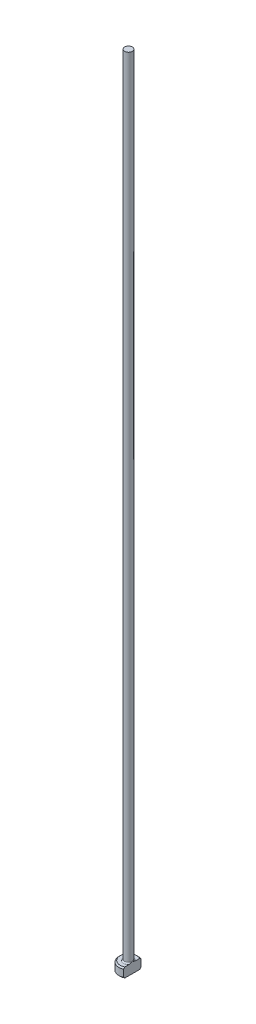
ISO-10303-21;
HEADER;
FILE_DESCRIPTION(('STEP AP214'),'2;1');
FILE_NAME('part.step','',(''),(''),'','','');
FILE_SCHEMA(('AUTOMOTIVE_DESIGN { 1 0 10303 214 1 1 1 1 }'));
ENDSEC;
DATA;
#1=APPLICATION_CONTEXT('core data for automotive mechanical design processes');
#2=APPLICATION_PROTOCOL_DEFINITION('international standard','automotive_design',2000,#1);
#3=PRODUCT_CONTEXT('',#1,'mechanical');
#4=PRODUCT('Part','Part','',(#3));
#5=PRODUCT_RELATED_PRODUCT_CATEGORY('part','',(#4));
#6=PRODUCT_DEFINITION_FORMATION('','',#4);
#7=PRODUCT_DEFINITION_CONTEXT('part definition',#1,'design');
#8=PRODUCT_DEFINITION('design','',#6,#7);
#9=PRODUCT_DEFINITION_SHAPE('','',#8);
#10=(LENGTH_UNIT() NAMED_UNIT(*) SI_UNIT(.MILLI.,.METRE.));
#11=(NAMED_UNIT(*) PLANE_ANGLE_UNIT() SI_UNIT($,.RADIAN.));
#12=(NAMED_UNIT(*) SI_UNIT($,.STERADIAN.) SOLID_ANGLE_UNIT());
#13=UNCERTAINTY_MEASURE_WITH_UNIT(LENGTH_MEASURE(1.E-05),#10,'distance_accuracy_value','');
#14=(GEOMETRIC_REPRESENTATION_CONTEXT(3) GLOBAL_UNCERTAINTY_ASSIGNED_CONTEXT((#13)) GLOBAL_UNIT_ASSIGNED_CONTEXT((#10,
#11,#12)) REPRESENTATION_CONTEXT('',''));
#15=CARTESIAN_POINT('',(0.,0.,0.));
#16=DIRECTION('',(0.,0.,1.));
#17=DIRECTION('',(1.,0.,0.));
#18=AXIS2_PLACEMENT_3D('',#15,#16,#17);
#19=CARTESIAN_POINT('',(0.,0.,0.));
#20=DIRECTION('',(0.,-1.,0.));
#21=DIRECTION('',(0.,0.,-1.));
#22=AXIS2_PLACEMENT_3D('',#19,#20,#21);
#23=PLANE('',#22);
#24=CARTESIAN_POINT('',(0.,0.,0.));
#25=DIRECTION('',(0.,-1.,0.));
#26=DIRECTION('',(0.,0.,-1.));
#27=AXIS2_PLACEMENT_3D('',#24,#25,#26);
#28=CIRCLE('',#27,1.29999999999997);
#29=CARTESIAN_POINT('',(0.599999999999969,0.,1.15325625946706));
#30=VERTEX_POINT('',#29);
#31=CARTESIAN_POINT('',(0.599999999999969,0.,-1.15325625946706));
#32=VERTEX_POINT('',#31);
#33=EDGE_CURVE('E98',#30,#32,#28,.T.);
#34=ORIENTED_EDGE('',*,*,#33,.T.);
#35=DIRECTION('',(0.,0.,1.));
#36=VECTOR('',#35,1.);
#37=CARTESIAN_POINT('',(0.599999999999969,0.,-1.37477270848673));
#38=LINE('',#37,#36);
#39=EDGE_CURVE('E83',#32,#30,#38,.T.);
#40=ORIENTED_EDGE('',*,*,#39,.T.);
#41=EDGE_LOOP('',(#34,#40));
#42=FACE_BOUND('',#41,.T.);
#43=ADVANCED_FACE('F32',(#42),#23,.T.);
#44=CARTESIAN_POINT('',(0.,259.958771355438,0.));
#45=DIRECTION('',(0.,1.,0.));
#46=DIRECTION('',(0.,0.,1.));
#47=AXIS2_PLACEMENT_3D('',#44,#45,#46);
#48=CYLINDRICAL_SURFACE('',#47,1.49999999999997);
#49=CARTESIAN_POINT('',(0.,1.29999999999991,0.));
#50=DIRECTION('',(0.,1.,0.));
#51=DIRECTION('',(0.,0.,1.));
#52=AXIS2_PLACEMENT_3D('',#49,#50,#51);
#53=CIRCLE('',#52,1.49999999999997);
#54=CARTESIAN_POINT('',(0.599999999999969,1.29999999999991,1.37477270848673));
#55=VERTEX_POINT('',#54);
#56=CARTESIAN_POINT('',(0.599999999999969,1.29999999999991,-1.37477270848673));
#57=VERTEX_POINT('',#56);
#58=EDGE_CURVE('E104',#55,#57,#53,.F.);
#59=ORIENTED_EDGE('',*,*,#58,.T.);
#60=DIRECTION('',(0.,-1.,0.));
#61=VECTOR('',#60,1.);
#62=CARTESIAN_POINT('',(0.599999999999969,125.,-1.37477270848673));
#63=LINE('',#62,#61);
#64=CARTESIAN_POINT('',(0.599999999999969,0.200000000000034,-1.37477270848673));
#65=VERTEX_POINT('',#64);
#66=EDGE_CURVE('E183',#57,#65,#63,.T.);
#67=ORIENTED_EDGE('',*,*,#66,.T.);
#68=CARTESIAN_POINT('',(0.,0.200000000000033,0.));
#69=DIRECTION('',(0.,-1.,0.));
#70=DIRECTION('',(0.,0.,-1.));
#71=AXIS2_PLACEMENT_3D('',#68,#69,#70);
#72=CIRCLE('',#71,1.49999999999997);
#73=CARTESIAN_POINT('',(0.599999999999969,0.200000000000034,1.37477270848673));
#74=VERTEX_POINT('',#73);
#75=EDGE_CURVE('E100',#65,#74,#72,.F.);
#76=ORIENTED_EDGE('',*,*,#75,.T.);
#77=DIRECTION('',(0.,-1.,0.));
#78=VECTOR('',#77,1.);
#79=CARTESIAN_POINT('',(0.599999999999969,125.,1.37477270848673));
#80=LINE('',#79,#78);
#81=EDGE_CURVE('E93',#55,#74,#80,.T.);
#82=ORIENTED_EDGE('',*,*,#81,.F.);
#83=EDGE_LOOP('',(#59,#67,#76,#82));
#84=FACE_BOUND('',#83,.T.);
#85=ADVANCED_FACE('F158',(#84),#48,.T.);
#86=CARTESIAN_POINT('',(-1.49999999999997,1.5,0.));
#87=DIRECTION('',(0.,1.,0.));
#88=DIRECTION('',(0.,0.,1.));
#89=AXIS2_PLACEMENT_3D('',#86,#87,#88);
#90=PLANE('',#89);
#91=CARTESIAN_POINT('',(0.,1.5,0.));
#92=DIRECTION('',(0.,1.,0.));
#93=DIRECTION('',(0.,0.,1.));
#94=AXIS2_PLACEMENT_3D('',#91,#92,#93);
#95=CIRCLE('',#94,1.29999999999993);
#96=CARTESIAN_POINT('',(0.599999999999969,1.5,-1.15325625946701));
#97=VERTEX_POINT('',#96);
#98=CARTESIAN_POINT('',(0.599999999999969,1.5,1.15325625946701));
#99=VERTEX_POINT('',#98);
#100=EDGE_CURVE('E178',#97,#99,#95,.T.);
#101=ORIENTED_EDGE('',*,*,#100,.T.);
#102=DIRECTION('',(0.,0.,-1.));
#103=VECTOR('',#102,1.);
#104=CARTESIAN_POINT('',(0.599999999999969,1.5,0.));
#105=LINE('',#104,#103);
#106=CARTESIAN_POINT('',(0.599999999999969,1.49999999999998,0.529150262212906));
#107=VERTEX_POINT('',#106);
#108=EDGE_CURVE('E57',#99,#107,#105,.T.);
#109=ORIENTED_EDGE('',*,*,#108,.T.);
#110=CARTESIAN_POINT('',(0.,1.5,0.));
#111=DIRECTION('',(0.,1.,0.));
#112=DIRECTION('',(0.,0.,1.));
#113=AXIS2_PLACEMENT_3D('',#110,#111,#112);
#114=CIRCLE('',#113,0.799999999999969);
#115=CARTESIAN_POINT('',(0.599999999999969,1.49999999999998,-0.529150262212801));
#116=VERTEX_POINT('',#115);
#117=EDGE_CURVE('E107',#107,#116,#114,.F.);
#118=ORIENTED_EDGE('',*,*,#117,.T.);
#119=EDGE_CURVE('E136',#116,#97,#105,.T.);
#120=ORIENTED_EDGE('',*,*,#119,.T.);
#121=EDGE_LOOP('',(#101,#109,#118,#120));
#122=FACE_BOUND('',#121,.T.);
#123=ADVANCED_FACE('F147',(#122),#90,.T.);
#124=CARTESIAN_POINT('',(0.,1.5,0.));
#125=DIRECTION('',(0.,-1.,0.));
#126=DIRECTION('',(0.,0.,-1.));
#127=AXIS2_PLACEMENT_3D('',#124,#125,#126);
#128=CONICAL_SURFACE('',#127,1.29999999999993,0.785398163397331);
#129=ORIENTED_EDGE('',*,*,#58,.F.);
#130=CARTESIAN_POINT('',(0.599999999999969,-0.287911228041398,3.02905855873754));
#131=CARTESIAN_POINT('',(0.599999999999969,-0.213665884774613,2.95336754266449));
#132=CARTESIAN_POINT('',(0.599999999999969,-0.139470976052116,2.87762699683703));
#133=CARTESIAN_POINT('',(0.599999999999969,0.00889104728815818,2.72590281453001));
#134=CARTESIAN_POINT('',(0.599999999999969,0.0830579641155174,2.64991898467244));
#135=CARTESIAN_POINT('',(0.599999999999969,0.233054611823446,2.49590131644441));
#136=CARTESIAN_POINT('',(0.599999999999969,0.308880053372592,2.41786329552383));
#137=CARTESIAN_POINT('',(0.599999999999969,0.460177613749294,2.26166700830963));
#138=CARTESIAN_POINT('',(0.599999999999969,0.535650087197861,2.18350908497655));
#139=CARTESIAN_POINT('',(0.599999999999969,0.747597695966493,1.96314022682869));
#140=CARTESIAN_POINT('',(0.599999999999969,0.883715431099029,1.82058320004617));
#141=CARTESIAN_POINT('',(0.599999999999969,1.08677998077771,1.60489754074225));
#142=CARTESIAN_POINT('',(0.599999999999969,1.15447989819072,1.53247863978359));
#143=CARTESIAN_POINT('',(0.599999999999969,1.28906472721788,1.38697516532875));
#144=CARTESIAN_POINT('',(0.599999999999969,1.35595015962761,1.31389107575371));
#145=CARTESIAN_POINT('',(0.599999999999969,1.48698128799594,1.16833124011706));
#146=CARTESIAN_POINT('',(0.599999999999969,1.55115458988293,1.09588037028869));
#147=CARTESIAN_POINT('',(0.599999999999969,1.67776408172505,0.949120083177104));
#148=CARTESIAN_POINT('',(0.599999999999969,1.74019534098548,0.8748063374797));
#149=CARTESIAN_POINT('',(0.599999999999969,1.83074985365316,0.761537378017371));
#150=CARTESIAN_POINT('',(0.599999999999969,1.86026258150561,0.723698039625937));
#151=CARTESIAN_POINT('',(0.599999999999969,1.91795850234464,0.647023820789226));
#152=CARTESIAN_POINT('',(0.599999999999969,1.94614205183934,0.608189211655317));
#153=CARTESIAN_POINT('',(0.599999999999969,2.00040823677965,0.529306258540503));
#154=CARTESIAN_POINT('',(0.599999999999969,2.02649909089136,0.489263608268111));
#155=CARTESIAN_POINT('',(0.599999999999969,2.07554904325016,0.407318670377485));
#156=CARTESIAN_POINT('',(0.599999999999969,2.09851337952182,0.365419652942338));
#157=CARTESIAN_POINT('',(0.599999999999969,2.12324895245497,0.313139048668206));
#158=CARTESIAN_POINT('',(0.599999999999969,2.1274717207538,0.303913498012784));
#159=CARTESIAN_POINT('',(0.599999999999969,2.13565719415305,0.285343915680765));
#160=CARTESIAN_POINT('',(0.599999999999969,2.13961980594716,0.275999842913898));
#161=CARTESIAN_POINT('',(0.599999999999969,2.1510730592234,0.247792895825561));
#162=CARTESIAN_POINT('',(0.599999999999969,2.15813129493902,0.228750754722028));
#163=CARTESIAN_POINT('',(0.599999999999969,2.17074315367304,0.190486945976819));
#164=CARTESIAN_POINT('',(0.599999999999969,2.17631779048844,0.17127227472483));
#165=CARTESIAN_POINT('',(0.599999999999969,2.18584668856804,0.132432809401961));
#166=CARTESIAN_POINT('',(0.599999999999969,2.18980047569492,0.112807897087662));
#167=CARTESIAN_POINT('',(0.599999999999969,2.19592362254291,0.07284263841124));
#168=CARTESIAN_POINT('',(0.599999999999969,2.19805268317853,0.0524959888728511));
#169=CARTESIAN_POINT('',(0.599999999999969,2.20023157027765,0.0116969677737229));
#170=CARTESIAN_POINT('',(0.599999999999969,2.20028214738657,-0.00875536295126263));
#171=CARTESIAN_POINT('',(0.599999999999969,2.19830107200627,-0.0495737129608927));
#172=CARTESIAN_POINT('',(0.599999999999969,2.19626778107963,-0.0699396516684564));
#173=CARTESIAN_POINT('',(0.599999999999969,2.19025850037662,-0.110389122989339));
#174=CARTESIAN_POINT('',(0.599999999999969,2.18628111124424,-0.130472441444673));
#175=CARTESIAN_POINT('',(0.599999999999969,2.16914542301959,-0.200965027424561));
#176=CARTESIAN_POINT('',(0.599999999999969,2.15130072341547,-0.250247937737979));
#177=CARTESIAN_POINT('',(0.599999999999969,2.1194579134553,-0.321874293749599));
#178=CARTESIAN_POINT('',(0.599999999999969,2.10794198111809,-0.345455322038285));
#179=CARTESIAN_POINT('',(0.599999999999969,2.083602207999,-0.391937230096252));
#180=CARTESIAN_POINT('',(0.599999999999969,2.07077874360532,-0.414838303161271));
#181=CARTESIAN_POINT('',(0.599999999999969,2.02919739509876,-0.485443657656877));
#182=CARTESIAN_POINT('',(0.599999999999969,1.99871708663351,-0.532120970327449));
#183=CARTESIAN_POINT('',(0.599999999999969,1.93517364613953,-0.62369911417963));
#184=CARTESIAN_POINT('',(0.599999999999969,1.90210805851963,-0.668598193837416));
#185=CARTESIAN_POINT('',(0.599999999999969,1.83427181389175,-0.757262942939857));
#186=CARTESIAN_POINT('',(0.599999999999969,1.79949703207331,-0.801025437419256));
#187=CARTESIAN_POINT('',(0.599999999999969,1.72886323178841,-0.887669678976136));
#188=CARTESIAN_POINT('',(0.599999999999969,1.69300406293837,-0.930551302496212));
#189=CARTESIAN_POINT('',(0.599999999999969,1.58401668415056,-1.05861145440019));
#190=CARTESIAN_POINT('',(0.599999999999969,1.50977131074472,-1.14283610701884));
#191=CARTESIAN_POINT('',(0.599999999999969,1.35983766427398,-1.30972078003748));
#192=CARTESIAN_POINT('',(0.599999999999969,1.28415199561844,-1.39238316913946));
#193=CARTESIAN_POINT('',(0.599999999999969,1.08473193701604,-1.60770200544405));
#194=CARTESIAN_POINT('',(0.599999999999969,0.960236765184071,-1.7396528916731));
#195=CARTESIAN_POINT('',(0.599999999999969,0.709941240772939,-2.00247228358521));
#196=CARTESIAN_POINT('',(0.599999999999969,0.584140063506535,-2.13333999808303));
#197=CARTESIAN_POINT('',(0.599999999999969,0.334155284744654,-2.39196201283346));
#198=CARTESIAN_POINT('',(0.599999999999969,0.209984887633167,-2.51972907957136));
#199=CARTESIAN_POINT('',(0.599999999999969,-0.0387233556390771,-2.7747209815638));
#200=CARTESIAN_POINT('',(0.599999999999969,-0.163260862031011,-2.90194614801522));
#201=CARTESIAN_POINT('',(0.599999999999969,-0.287911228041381,-3.02905855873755));
#202=B_SPLINE_CURVE_WITH_KNOTS('',3,(#130,#131,#132,#133,#134,#135,#136,#137,#138,#139,#140,
#141,#142,#143,#144,#145,#146,#147,#148,#149,#150,#151,#152,#153,#154,#155,#156,#157,#158,#159,
#160,#161,#162,#163,#164,#165,#166,#167,#168,#169,#170,#171,#172,#173,#174,#175,#176,#177,#178,
#179,#180,#181,#182,#183,#184,#185,#186,#187,#188,#189,#190,#191,#192,#193,#194,#195,#196,#197,
#198,#199,#200,#201),.UNSPECIFIED.,.F.,.F.,(4,2,2,2,2,2,2,2,2,2,2,2,2,2,2,2,2,2,2,2,2,2,2,2,2,2,
2,2,2,2,2,2,2,2,2,4),(0.,0.318077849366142,0.636618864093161,0.963045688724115,1.28899494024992,
1.8802974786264,2.17769995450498,2.47490106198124,2.76524428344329,3.05633964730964,
3.20028481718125,3.34419115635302,3.48750141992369,3.63056855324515,3.66100321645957,
3.69144873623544,3.75232470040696,3.81228598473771,3.8722647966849,3.93353641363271,
3.99478590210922,4.0560835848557,4.11742545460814,4.2736188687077,4.35234029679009,
4.43103912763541,4.59811604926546,4.76535364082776,4.93301680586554,5.10070333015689,
5.43748879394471,5.77371427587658,6.31792757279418,6.86250841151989,7.39700123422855,
7.93109866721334),.UNSPECIFIED.);
#203=EDGE_CURVE('E135',#55,#99,#202,.T.);
#204=ORIENTED_EDGE('',*,*,#203,.T.);
#205=ORIENTED_EDGE('',*,*,#100,.F.);
#206=EDGE_CURVE('E127',#97,#57,#202,.T.);
#207=ORIENTED_EDGE('',*,*,#206,.T.);
#208=EDGE_LOOP('',(#129,#204,#205,#207));
#209=FACE_BOUND('',#208,.T.);
#210=ADVANCED_FACE('F143',(#209),#128,.T.);
#211=CARTESIAN_POINT('',(0.,0.200000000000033,0.));
#212=DIRECTION('',(0.,1.,0.));
#213=DIRECTION('',(0.,0.,1.));
#214=AXIS2_PLACEMENT_3D('',#211,#212,#213);
#215=CONICAL_SURFACE('',#214,1.49999999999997,0.785398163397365);
#216=ORIENTED_EDGE('',*,*,#75,.F.);
#217=CARTESIAN_POINT('',(0.599999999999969,1.78791122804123,-3.02905855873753));
#218=CARTESIAN_POINT('',(0.599999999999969,1.71366588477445,-2.95336754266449));
#219=CARTESIAN_POINT('',(0.599999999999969,1.63947097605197,-2.87762699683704));
#220=CARTESIAN_POINT('',(0.599999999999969,1.49110895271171,-2.72590281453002));
#221=CARTESIAN_POINT('',(0.599999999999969,1.41694203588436,-2.64991898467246));
#222=CARTESIAN_POINT('',(0.599999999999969,1.26694538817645,-2.49590131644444));
#223=CARTESIAN_POINT('',(0.599999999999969,1.19111994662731,-2.41786329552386));
#224=CARTESIAN_POINT('',(0.599999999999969,1.03982238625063,-2.26166700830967));
#225=CARTESIAN_POINT('',(0.599999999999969,0.964349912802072,-2.18350908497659));
#226=CARTESIAN_POINT('',(0.599999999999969,0.752402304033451,-1.96314022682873));
#227=CARTESIAN_POINT('',(0.599999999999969,0.616284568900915,-1.8205832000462));
#228=CARTESIAN_POINT('',(0.599999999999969,0.413220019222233,-1.60489754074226));
#229=CARTESIAN_POINT('',(0.599999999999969,0.345520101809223,-1.5324786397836));
#230=CARTESIAN_POINT('',(0.599999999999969,0.210935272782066,-1.38697516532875));
#231=CARTESIAN_POINT('',(0.599999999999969,0.144049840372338,-1.31389107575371));
#232=CARTESIAN_POINT('',(0.599999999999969,0.013018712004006,-1.16833124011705));
#233=CARTESIAN_POINT('',(0.599999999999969,-0.051154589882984,-1.09588037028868));
#234=CARTESIAN_POINT('',(0.599999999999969,-0.177764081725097,-0.949120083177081));
#235=CARTESIAN_POINT('',(0.599999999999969,-0.240195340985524,-0.874806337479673));
#236=CARTESIAN_POINT('',(0.599999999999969,-0.330749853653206,-0.761537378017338));
#237=CARTESIAN_POINT('',(0.599999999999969,-0.360262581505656,-0.723698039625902));
#238=CARTESIAN_POINT('',(0.599999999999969,-0.417958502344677,-0.647023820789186));
#239=CARTESIAN_POINT('',(0.599999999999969,-0.446142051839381,-0.608189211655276));
#240=CARTESIAN_POINT('',(0.599999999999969,-0.500408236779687,-0.529306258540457));
#241=CARTESIAN_POINT('',(0.599999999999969,-0.526499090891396,-0.489263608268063));
#242=CARTESIAN_POINT('',(0.599999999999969,-0.575549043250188,-0.407318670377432));
#243=CARTESIAN_POINT('',(0.599999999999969,-0.598513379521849,-0.365419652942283));
#244=CARTESIAN_POINT('',(0.599999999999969,-0.623248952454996,-0.313139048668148));
#245=CARTESIAN_POINT('',(0.599999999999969,-0.627471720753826,-0.303913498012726));
#246=CARTESIAN_POINT('',(0.599999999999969,-0.635657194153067,-0.285343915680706));
#247=CARTESIAN_POINT('',(0.599999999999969,-0.639619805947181,-0.275999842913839));
#248=CARTESIAN_POINT('',(0.599999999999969,-0.651073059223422,-0.2477928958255));
#249=CARTESIAN_POINT('',(0.599999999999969,-0.65813129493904,-0.228750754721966));
#250=CARTESIAN_POINT('',(0.599999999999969,-0.670743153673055,-0.190486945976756));
#251=CARTESIAN_POINT('',(0.599999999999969,-0.676317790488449,-0.171272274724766));
#252=CARTESIAN_POINT('',(0.599999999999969,-0.685846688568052,-0.132432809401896));
#253=CARTESIAN_POINT('',(0.599999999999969,-0.689800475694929,-0.112807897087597));
#254=CARTESIAN_POINT('',(0.599999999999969,-0.695923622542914,-0.0728426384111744));
#255=CARTESIAN_POINT('',(0.599999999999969,-0.69805268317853,-0.0524959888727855));
#256=CARTESIAN_POINT('',(0.599999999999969,-0.700231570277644,-0.0116969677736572));
#257=CARTESIAN_POINT('',(0.599999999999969,-0.700282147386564,0.0087553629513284));
#258=CARTESIAN_POINT('',(0.599999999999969,-0.698301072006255,0.0495737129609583));
#259=CARTESIAN_POINT('',(0.599999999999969,-0.696267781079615,0.0699396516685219));
#260=CARTESIAN_POINT('',(0.599999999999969,-0.690258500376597,0.110389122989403));
#261=CARTESIAN_POINT('',(0.599999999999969,-0.68628111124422,0.130472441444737));
#262=CARTESIAN_POINT('',(0.599999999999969,-0.669145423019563,0.200965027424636));
#263=CARTESIAN_POINT('',(0.599999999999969,-0.651300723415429,0.250247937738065));
#264=CARTESIAN_POINT('',(0.599999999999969,-0.619457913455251,0.321874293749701));
#265=CARTESIAN_POINT('',(0.599999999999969,-0.607941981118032,0.345455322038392));
#266=CARTESIAN_POINT('',(0.599999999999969,-0.583602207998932,0.391937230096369));
#267=CARTESIAN_POINT('',(0.599999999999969,-0.57077874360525,0.414838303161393));
#268=CARTESIAN_POINT('',(0.599999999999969,-0.529197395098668,0.48544365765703));
#269=CARTESIAN_POINT('',(0.599999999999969,-0.498717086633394,0.532120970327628));
#270=CARTESIAN_POINT('',(0.599999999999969,-0.435173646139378,0.62369911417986));
#271=CARTESIAN_POINT('',(0.599999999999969,-0.402108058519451,0.668598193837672));
#272=CARTESIAN_POINT('',(0.599999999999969,-0.334271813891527,0.757262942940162));
#273=CARTESIAN_POINT('',(0.599999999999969,-0.299497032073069,0.801025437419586));
#274=CARTESIAN_POINT('',(0.599999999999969,-0.228863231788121,0.887669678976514));
#275=CARTESIAN_POINT('',(0.599999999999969,-0.193004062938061,0.930551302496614));
#276=CARTESIAN_POINT('',(0.599999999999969,-0.0840166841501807,1.05861145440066));
#277=CARTESIAN_POINT('',(0.599999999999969,-0.00977131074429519,1.14283610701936));
#278=CARTESIAN_POINT('',(0.599999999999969,0.140162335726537,1.3097207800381));
#279=CARTESIAN_POINT('',(0.599999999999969,0.215848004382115,1.39238316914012));
#280=CARTESIAN_POINT('',(0.599999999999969,0.415268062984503,1.6077020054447));
#281=CARTESIAN_POINT('',(0.599999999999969,0.539763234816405,1.73965289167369));
#282=CARTESIAN_POINT('',(0.599999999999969,0.790058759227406,2.00247228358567));
#283=CARTESIAN_POINT('',(0.599999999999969,0.915859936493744,2.13333999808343));
#284=CARTESIAN_POINT('',(0.599999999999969,1.16584471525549,2.39196201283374));
#285=CARTESIAN_POINT('',(0.599999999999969,1.29001511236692,2.51972907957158));
#286=CARTESIAN_POINT('',(0.599999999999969,1.53872335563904,2.77472098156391));
#287=CARTESIAN_POINT('',(0.599999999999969,1.66326086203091,2.90194614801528));
#288=CARTESIAN_POINT('',(0.599999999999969,1.78791122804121,3.02905855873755));
#289=B_SPLINE_CURVE_WITH_KNOTS('',3,(#217,#218,#219,#220,#221,#222,#223,#224,#225,#226,#227,
#228,#229,#230,#231,#232,#233,#234,#235,#236,#237,#238,#239,#240,#241,#242,#243,#244,#245,#246,
#247,#248,#249,#250,#251,#252,#253,#254,#255,#256,#257,#258,#259,#260,#261,#262,#263,#264,#265,
#266,#267,#268,#269,#270,#271,#272,#273,#274,#275,#276,#277,#278,#279,#280,#281,#282,#283,#284,
#285,#286,#287,#288),.UNSPECIFIED.,.F.,.F.,(4,2,2,2,2,2,2,2,2,2,2,2,2,2,2,2,2,2,2,2,2,2,2,2,2,2,
2,2,2,2,2,2,2,2,2,4),(0.,0.318077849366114,0.636618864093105,0.963045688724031,1.28899494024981,
1.8802974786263,2.17769995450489,2.47490106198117,2.76524428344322,3.05633964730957,
3.20028481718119,3.34419115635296,3.48750141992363,3.6305685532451,3.66100321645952,
3.69144873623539,3.75232470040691,3.81228598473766,3.87226479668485,3.93353641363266,
3.99478590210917,4.05608358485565,4.11742545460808,4.27361886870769,4.3523402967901,
4.43103912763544,4.59811604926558,4.76535364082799,4.93301680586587,5.10070333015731,
5.43748879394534,5.7737142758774,6.31792757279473,6.86250841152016,7.39700123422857,
7.93109866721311),.UNSPECIFIED.);
#290=EDGE_CURVE('E86',#65,#32,#289,.T.);
#291=ORIENTED_EDGE('',*,*,#290,.T.);
#292=ORIENTED_EDGE('',*,*,#33,.F.);
#293=EDGE_CURVE('E89',#30,#74,#289,.T.);
#294=ORIENTED_EDGE('',*,*,#293,.T.);
#295=EDGE_LOOP('',(#216,#291,#292,#294));
#296=FACE_BOUND('',#295,.T.);
#297=ADVANCED_FACE('F97',(#296),#215,.T.);
#298=CARTESIAN_POINT('',(0.,1.69999999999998,0.));
#299=DIRECTION('',(0.,1.,0.));
#300=DIRECTION('',(0.,0.,1.));
#301=AXIS2_PLACEMENT_3D('',#298,#299,#300);
#302=TOROIDAL_SURFACE('',#301,0.799999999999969,0.2);
#303=CARTESIAN_POINT('',(0.599999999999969,1.69999999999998,0.));
#304=CARTESIAN_POINT('',(0.599999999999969,1.70000053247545,-1.15141194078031E-09));
#305=CARTESIAN_POINT('',(0.599999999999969,1.7000010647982,-7.21919696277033E-08));
#306=CARTESIAN_POINT('',(0.599999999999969,1.70000210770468,-3.14257982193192E-07));
#307=CARTESIAN_POINT('',(0.599999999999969,1.70000261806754,-4.86120593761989E-07));
#308=CARTESIAN_POINT('',(0.599999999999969,1.70000362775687,-9.06941799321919E-07));
#309=CARTESIAN_POINT('',(0.599999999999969,1.70000412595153,-1.15855012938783E-06));
#310=CARTESIAN_POINT('',(0.599999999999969,1.70000508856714,-1.71575007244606E-06));
#311=CARTESIAN_POINT('',(0.599999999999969,1.70000555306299,-2.02121643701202E-06));
#312=CARTESIAN_POINT('',(0.599999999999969,1.700007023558,-3.07289392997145E-06));
#313=CARTESIAN_POINT('',(0.599999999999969,1.7000079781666,-3.89144377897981E-06));
#314=CARTESIAN_POINT('',(0.599999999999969,1.70000975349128,-5.63270194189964E-06));
#315=CARTESIAN_POINT('',(0.599999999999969,1.70001057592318,-6.55375775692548E-06));
#316=CARTESIAN_POINT('',(0.599999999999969,1.70001343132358,-9.94112084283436E-06));
#317=CARTESIAN_POINT('',(0.599999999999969,1.70001531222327,-1.25381888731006E-05));
#318=CARTESIAN_POINT('',(0.599999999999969,1.70001859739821,-1.78227081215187E-05));
#319=CARTESIAN_POINT('',(0.599999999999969,1.70002002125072,-2.04985915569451E-05));
#320=CARTESIAN_POINT('',(0.599999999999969,1.70002561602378,-3.12399874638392E-05));
#321=CARTESIAN_POINT('',(0.599999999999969,1.70002959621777,-3.94002329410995E-05));
#322=CARTESIAN_POINT('',(0.599999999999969,1.7000364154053,-5.50529095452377E-05));
#323=CARTESIAN_POINT('',(0.599999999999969,1.70003933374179,-6.25098784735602E-05));
#324=CARTESIAN_POINT('',(0.599999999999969,1.70006102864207,-0.000113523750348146));
#325=CARTESIAN_POINT('',(0.599999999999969,1.70008698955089,-0.000153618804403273));
#326=CARTESIAN_POINT('',(0.599999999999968,1.70018105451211,-0.000305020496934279));
#327=CARTESIAN_POINT('',(0.599999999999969,1.70024383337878,-0.000418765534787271));
#328=CARTESIAN_POINT('',(0.599999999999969,1.7004829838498,-0.000844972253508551));
#329=CARTESIAN_POINT('',(0.599999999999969,1.70066486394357,-0.00115493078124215));
#330=CARTESIAN_POINT('',(0.599999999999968,1.70138503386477,-0.00238898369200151));
#331=CARTESIAN_POINT('',(0.599999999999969,1.70191713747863,-0.0033158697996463));
#332=CARTESIAN_POINT('',(0.599999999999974,1.71148793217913,-0.0199795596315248));
#333=CARTESIAN_POINT('',(0.59999999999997,1.72058486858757,-0.0356908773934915));
#334=CARTESIAN_POINT('',(0.599999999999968,1.73832586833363,-0.0667184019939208));
#335=CARTESIAN_POINT('',(0.599999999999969,1.74697521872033,-0.0820317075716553));
#336=CARTESIAN_POINT('',(0.599999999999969,1.76488296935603,-0.11432388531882));
#337=CARTESIAN_POINT('',(0.599999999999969,1.77411633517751,-0.131316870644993));
#338=CARTESIAN_POINT('',(0.599999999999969,1.79218965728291,-0.165698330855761));
#339=CARTESIAN_POINT('',(0.599999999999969,1.80102554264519,-0.183088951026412));
#340=CARTESIAN_POINT('',(0.599999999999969,1.82263923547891,-0.227696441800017));
#341=CARTESIAN_POINT('',(0.599999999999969,1.83496283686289,-0.255138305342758));
#342=CARTESIAN_POINT('',(0.599999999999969,1.85701285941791,-0.310418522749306));
#343=CARTESIAN_POINT('',(0.599999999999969,1.86678784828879,-0.338236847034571));
#344=CARTESIAN_POINT('',(0.599999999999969,1.87956548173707,-0.382495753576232));
#345=CARTESIAN_POINT('',(0.599999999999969,1.8836636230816,-0.398615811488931));
#346=CARTESIAN_POINT('',(0.599999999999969,1.89064725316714,-0.431187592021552));
#347=CARTESIAN_POINT('',(0.599999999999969,1.89352682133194,-0.447640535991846));
#348=CARTESIAN_POINT('',(0.599999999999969,1.90011661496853,-0.49857474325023));
#349=CARTESIAN_POINT('',(0.599999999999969,1.90140980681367,-0.533480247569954));
#350=CARTESIAN_POINT('',(0.599999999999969,1.89686480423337,-0.58352985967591));
#351=CARTESIAN_POINT('',(0.599999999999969,1.89454911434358,-0.599011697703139));
#352=CARTESIAN_POINT('',(0.599999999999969,1.88786997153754,-0.629428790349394));
#353=CARTESIAN_POINT('',(0.599999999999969,1.88352170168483,-0.64436722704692));
#354=CARTESIAN_POINT('',(0.599999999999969,1.87245798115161,-0.673599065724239));
#355=CARTESIAN_POINT('',(0.599999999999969,1.86571024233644,-0.687880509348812));
#356=CARTESIAN_POINT('',(0.599999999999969,1.84965008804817,-0.714957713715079));
#357=CARTESIAN_POINT('',(0.599999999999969,1.84033955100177,-0.727754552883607));
#358=CARTESIAN_POINT('',(0.599999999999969,1.82259590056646,-0.747236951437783));
#359=CARTESIAN_POINT('',(0.599999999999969,1.81485840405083,-0.75455813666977));
#360=CARTESIAN_POINT('',(0.599999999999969,1.79828948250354,-0.767841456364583));
#361=CARTESIAN_POINT('',(0.599999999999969,1.78945892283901,-0.773804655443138));
#362=CARTESIAN_POINT('',(0.599999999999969,1.77080543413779,-0.784105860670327));
#363=CARTESIAN_POINT('',(0.599999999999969,1.76097594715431,-0.788432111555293));
#364=CARTESIAN_POINT('',(0.599999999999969,1.74066851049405,-0.795124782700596));
#365=CARTESIAN_POINT('',(0.599999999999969,1.73019096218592,-0.797492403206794));
#366=CARTESIAN_POINT('',(0.599999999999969,1.71019102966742,-0.799954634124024));
#367=CARTESIAN_POINT('',(0.599999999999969,1.70069636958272,-0.800278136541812));
#368=CARTESIAN_POINT('',(0.599999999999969,1.68180115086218,-0.799242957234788));
#369=CARTESIAN_POINT('',(0.599999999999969,1.67240056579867,-0.797884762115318));
#370=CARTESIAN_POINT('',(0.599999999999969,1.65439769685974,-0.793663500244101));
#371=CARTESIAN_POINT('',(0.599999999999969,1.64577854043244,-0.790871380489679));
#372=CARTESIAN_POINT('',(0.599999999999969,1.62909204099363,-0.783962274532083));
#373=CARTESIAN_POINT('',(0.599999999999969,1.62102476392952,-0.77984513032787));
#374=CARTESIAN_POINT('',(0.599999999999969,1.60511409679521,-0.770167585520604));
#375=CARTESIAN_POINT('',(0.599999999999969,1.59731583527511,-0.76453334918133));
#376=CARTESIAN_POINT('',(0.599999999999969,1.58262481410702,-0.752193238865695));
#377=CARTESIAN_POINT('',(0.599999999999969,1.57573246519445,-0.745486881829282));
#378=CARTESIAN_POINT('',(0.599999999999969,1.56029840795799,-0.728319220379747));
#379=CARTESIAN_POINT('',(0.599999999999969,1.55222187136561,-0.71743830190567));
#380=CARTESIAN_POINT('',(0.599999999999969,1.53794452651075,-0.694498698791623));
#381=CARTESIAN_POINT('',(0.599999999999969,1.53174853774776,-0.682437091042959));
#382=CARTESIAN_POINT('',(0.599999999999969,1.51926782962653,-0.653177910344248));
#383=CARTESIAN_POINT('',(0.599999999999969,1.51371982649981,-0.635667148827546));
#384=CARTESIAN_POINT('',(0.599999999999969,1.50550234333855,-0.600065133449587));
#385=CARTESIAN_POINT('',(0.599999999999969,1.50282657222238,-0.581975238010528));
#386=CARTESIAN_POINT('',(0.599999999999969,1.49919226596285,-0.536773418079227));
#387=CARTESIAN_POINT('',(0.599999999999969,1.49969917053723,-0.509547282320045));
#388=CARTESIAN_POINT('',(0.599999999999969,1.50488342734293,-0.455047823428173));
#389=CARTESIAN_POINT('',(0.599999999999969,1.50964012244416,-0.427783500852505));
#390=CARTESIAN_POINT('',(0.599999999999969,1.52379077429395,-0.367993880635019));
#391=CARTESIAN_POINT('',(0.599999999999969,1.53398732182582,-0.335665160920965));
#392=CARTESIAN_POINT('',(0.599999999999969,1.55767895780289,-0.272220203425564));
#393=CARTESIAN_POINT('',(0.599999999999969,1.57118109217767,-0.241106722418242));
#394=CARTESIAN_POINT('',(0.599999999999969,1.5990890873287,-0.182423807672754));
#395=CARTESIAN_POINT('',(0.599999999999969,1.61332903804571,-0.154773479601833));
#396=CARTESIAN_POINT('',(0.599999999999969,1.64269458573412,-0.100300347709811));
#397=CARTESIAN_POINT('',(0.59999999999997,1.65781032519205,-0.0734721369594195));
#398=CARTESIAN_POINT('',(0.599999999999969,1.67666349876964,-0.040501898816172));
#399=CARTESIAN_POINT('',(0.599999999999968,1.68024190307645,-0.0342655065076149));
#400=CARTESIAN_POINT('',(0.599999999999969,1.68840215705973,-0.0201022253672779));
#401=CARTESIAN_POINT('',(0.599999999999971,1.69299106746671,-0.0121789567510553));
#402=CARTESIAN_POINT('',(0.599999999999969,1.69807754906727,-0.00332537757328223));
#403=CARTESIAN_POINT('',(0.599999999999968,1.69860414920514,-0.00240791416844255));
#404=CARTESIAN_POINT('',(0.599999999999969,1.69932276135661,-0.0011764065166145));
#405=CARTESIAN_POINT('',(0.599999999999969,1.69950866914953,-0.000859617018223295));
#406=CARTESIAN_POINT('',(0.599999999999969,1.6997528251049,-0.000424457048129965));
#407=CARTESIAN_POINT('',(0.599999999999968,1.69981673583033,-0.000308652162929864));
#408=CARTESIAN_POINT('',(0.599999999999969,1.69991233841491,-0.000154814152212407));
#409=CARTESIAN_POINT('',(0.599999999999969,1.6999385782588,-0.000114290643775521));
#410=CARTESIAN_POINT('',(0.599999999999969,1.69996044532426,-6.27540150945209E-05));
#411=CARTESIAN_POINT('',(0.599999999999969,1.69996337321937,-5.52546386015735E-05));
#412=CARTESIAN_POINT('',(0.599999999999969,1.69997022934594,-3.95134344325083E-05));
#413=CARTESIAN_POINT('',(0.599999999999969,1.69997423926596,-3.13080767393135E-05));
#414=CARTESIAN_POINT('',(0.599999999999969,1.6999798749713,-2.05158223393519E-05));
#415=CARTESIAN_POINT('',(0.599999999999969,1.69998130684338,-1.78321761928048E-05));
#416=CARTESIAN_POINT('',(0.599999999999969,1.69998461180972,-1.25338082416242E-05));
#417=CARTESIAN_POINT('',(0.599999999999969,1.69998650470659,-9.93082536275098E-06));
#418=CARTESIAN_POINT('',(0.599999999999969,1.699989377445,-6.53827384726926E-06));
#419=CARTESIAN_POINT('',(0.599999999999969,1.69999020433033,-5.61654147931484E-06));
#420=CARTESIAN_POINT('',(0.599999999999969,1.69999198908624,-3.87485643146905E-06));
#421=CARTESIAN_POINT('',(0.599999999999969,1.6999929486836,-3.05657499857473E-06));
#422=CARTESIAN_POINT('',(0.599999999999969,1.69999442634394,-2.00636331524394E-06));
#423=CARTESIAN_POINT('',(0.599999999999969,1.69999489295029,-1.70153921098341E-06));
#424=CARTESIAN_POINT('',(0.599999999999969,1.69999585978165,-1.14598743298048E-06));
#425=CARTESIAN_POINT('',(0.599999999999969,1.69999636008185,-8.95386353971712E-07));
#426=CARTESIAN_POINT('',(0.599999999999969,1.69999737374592,-4.77020035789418E-07));
#427=CARTESIAN_POINT('',(0.599999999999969,1.69999788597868,-3.06581136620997E-07));
#428=CARTESIAN_POINT('',(0.599999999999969,1.6999989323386,-6.79168071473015E-08));
#429=CARTESIAN_POINT('',(0.599999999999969,1.69999946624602,1.15417651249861E-09));
#430=CARTESIAN_POINT('',(0.599999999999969,1.69999999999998,0.));
#431=B_SPLINE_CURVE_WITH_KNOTS('',3,(#303,#304,#305,#306,#307,#308,#309,#310,#311,#312,#313,
#314,#315,#316,#317,#318,#319,#320,#321,#322,#323,#324,#325,#326,#327,#328,#329,#330,#331,#332,
#333,#334,#335,#336,#337,#338,#339,#340,#341,#342,#343,#344,#345,#346,#347,#348,#349,#350,#351,
#352,#353,#354,#355,#356,#357,#358,#359,#360,#361,#362,#363,#364,#365,#366,#367,#368,#369,#370,
#371,#372,#373,#374,#375,#376,#377,#378,#379,#380,#381,#382,#383,#384,#385,#386,#387,#388,#389,
#390,#391,#392,#393,#394,#395,#396,#397,#398,#399,#400,#401,#402,#403,#404,#405,#406,#407,#408,
#409,#410,#411,#412,#413,#414,#415,#416,#417,#418,#419,#420,#421,#422,#423,#424,#425,#426,#427,
#428,#429,#430),.UNSPECIFIED.,.T.,.F.,(4,2,2,2,2,2,2,2,2,2,2,2,2,2,2,2,2,2,2,2,2,2,2,2,2,2,2,2,
2,2,2,2,2,2,2,2,2,2,2,2,2,2,2,2,2,2,2,2,2,2,2,2,2,2,2,2,2,2,2,2,2,2,2,4),(0.,
1.59574444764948E-06,3.20493023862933E-06,4.87446848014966E-06,6.54017417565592E-06,
1.0294697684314E-05,1.39956596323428E-05,2.35749063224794E-05,3.26601536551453E-05,
5.98833375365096E-05,8.38803593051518E-05,0.00022630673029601,0.000616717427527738,
0.00169407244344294,0.00490113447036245,0.0593566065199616,0.112119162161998,0.170131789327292,
0.228643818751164,0.31881804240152,0.407121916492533,0.456972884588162,0.50706335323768,
0.610835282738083,0.657688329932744,0.704196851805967,0.751356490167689,0.798481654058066,
0.830315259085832,0.862123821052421,0.894156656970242,0.926169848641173,0.9545235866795,
0.982869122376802,1.00993079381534,1.0369956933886,1.06574384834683,1.09450499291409,
1.13493371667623,1.1754651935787,1.2302660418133,1.28494661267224,1.36618745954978,
1.44897750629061,1.55039579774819,1.65203217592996,1.74530129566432,1.83767157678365,
1.85924264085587,1.88670680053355,1.88988115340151,1.8909822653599,1.89137974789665,
1.89152369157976,1.89154781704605,1.89157519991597,1.89158431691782,1.89159393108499,
1.89159764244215,1.89160140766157,1.89160307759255,1.89160475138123,1.89160636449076,
1.89160796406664),.UNSPECIFIED.);
#432=CARTESIAN_POINT('',(0.599999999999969,1.69999999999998,0.));
#433=VERTEX_POINT('',#432);
#434=EDGE_CURVE('E11',#116,#433,#431,.T.);
#435=ORIENTED_EDGE('',*,*,#434,.F.);
#436=ORIENTED_EDGE('',*,*,#117,.F.);
#437=CARTESIAN_POINT('',(0.599999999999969,1.69999999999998,0.));
#438=CARTESIAN_POINT('',(0.599999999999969,1.69999946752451,1.15141196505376E-09));
#439=CARTESIAN_POINT('',(0.599999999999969,1.69999893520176,7.21919696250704E-08));
#440=CARTESIAN_POINT('',(0.599999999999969,1.69999789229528,3.14257982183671E-07));
#441=CARTESIAN_POINT('',(0.599999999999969,1.69999738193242,4.86120593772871E-07));
#442=CARTESIAN_POINT('',(0.599999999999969,1.69999637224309,9.06941799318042E-07));
#443=CARTESIAN_POINT('',(0.599999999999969,1.69999587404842,1.15855012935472E-06));
#444=CARTESIAN_POINT('',(0.599999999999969,1.69999491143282,1.71575007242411E-06));
#445=CARTESIAN_POINT('',(0.599999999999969,1.69999444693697,2.02121643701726E-06));
#446=CARTESIAN_POINT('',(0.599999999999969,1.69999297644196,3.07289393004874E-06));
#447=CARTESIAN_POINT('',(0.599999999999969,1.69999202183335,3.89144377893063E-06));
#448=CARTESIAN_POINT('',(0.599999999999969,1.69999024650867,5.63270194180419E-06));
#449=CARTESIAN_POINT('',(0.599999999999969,1.69998942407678,6.5537577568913E-06));
#450=CARTESIAN_POINT('',(0.599999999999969,1.69998656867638,9.94112084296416E-06));
#451=CARTESIAN_POINT('',(0.599999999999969,1.69998468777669,1.25381888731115E-05));
#452=CARTESIAN_POINT('',(0.599999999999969,1.69998140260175,1.78227081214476E-05));
#453=CARTESIAN_POINT('',(0.599999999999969,1.69997997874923,2.04985915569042E-05));
#454=CARTESIAN_POINT('',(0.599999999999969,1.69997438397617,3.1239987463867E-05));
#455=CARTESIAN_POINT('',(0.599999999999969,1.69997040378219,3.94002329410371E-05));
#456=CARTESIAN_POINT('',(0.599999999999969,1.69996358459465,5.50529095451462E-05));
#457=CARTESIAN_POINT('',(0.599999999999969,1.69996066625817,6.25098784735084E-05));
#458=CARTESIAN_POINT('',(0.599999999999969,1.69993897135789,0.000113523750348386));
#459=CARTESIAN_POINT('',(0.599999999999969,1.69991301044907,0.000153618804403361));
#460=CARTESIAN_POINT('',(0.599999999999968,1.69981894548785,0.00030502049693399));
#461=CARTESIAN_POINT('',(0.599999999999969,1.69975616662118,0.000418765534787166));
#462=CARTESIAN_POINT('',(0.599999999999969,1.69951701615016,0.000844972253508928));
#463=CARTESIAN_POINT('',(0.599999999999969,1.69933513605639,0.0011549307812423));
#464=CARTESIAN_POINT('',(0.599999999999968,1.69861496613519,0.00238898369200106));
#465=CARTESIAN_POINT('',(0.599999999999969,1.69808286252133,0.00331586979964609));
#466=CARTESIAN_POINT('',(0.599999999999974,1.68851206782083,0.0199795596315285));
#467=CARTESIAN_POINT('',(0.59999999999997,1.67941513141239,0.0356908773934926));
#468=CARTESIAN_POINT('',(0.599999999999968,1.66167413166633,0.06671840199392));
#469=CARTESIAN_POINT('',(0.599999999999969,1.65302478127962,0.0820317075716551));
#470=CARTESIAN_POINT('',(0.599999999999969,1.63511703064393,0.114323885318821));
#471=CARTESIAN_POINT('',(0.599999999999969,1.62588366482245,0.131316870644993));
#472=CARTESIAN_POINT('',(0.599999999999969,1.60781034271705,0.165698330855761));
#473=CARTESIAN_POINT('',(0.599999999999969,1.59897445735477,0.183088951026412));
#474=CARTESIAN_POINT('',(0.599999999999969,1.57736076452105,0.227696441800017));
#475=CARTESIAN_POINT('',(0.599999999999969,1.56503716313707,0.255138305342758));
#476=CARTESIAN_POINT('',(0.599999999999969,1.54298714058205,0.310418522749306));
#477=CARTESIAN_POINT('',(0.599999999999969,1.53321215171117,0.338236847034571));
#478=CARTESIAN_POINT('',(0.599999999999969,1.52043451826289,0.382495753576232));
#479=CARTESIAN_POINT('',(0.599999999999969,1.51633637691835,0.398615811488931));
#480=CARTESIAN_POINT('',(0.599999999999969,1.50935274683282,0.431187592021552));
#481=CARTESIAN_POINT('',(0.599999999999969,1.50647317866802,0.447640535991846));
#482=CARTESIAN_POINT('',(0.599999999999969,1.49988338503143,0.49857474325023));
#483=CARTESIAN_POINT('',(0.599999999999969,1.49859019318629,0.533480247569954));
#484=CARTESIAN_POINT('',(0.599999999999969,1.50313519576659,0.58352985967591));
#485=CARTESIAN_POINT('',(0.599999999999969,1.50545088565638,0.599011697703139));
#486=CARTESIAN_POINT('',(0.599999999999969,1.51213002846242,0.629428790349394));
#487=CARTESIAN_POINT('',(0.599999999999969,1.51647829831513,0.64436722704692));
#488=CARTESIAN_POINT('',(0.599999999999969,1.52754201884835,0.673599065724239));
#489=CARTESIAN_POINT('',(0.599999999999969,1.53428975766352,0.687880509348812));
#490=CARTESIAN_POINT('',(0.599999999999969,1.55034991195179,0.714957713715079));
#491=CARTESIAN_POINT('',(0.599999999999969,1.55966044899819,0.727754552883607));
#492=CARTESIAN_POINT('',(0.599999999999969,1.5774040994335,0.747236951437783));
#493=CARTESIAN_POINT('',(0.599999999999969,1.58514159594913,0.75455813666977));
#494=CARTESIAN_POINT('',(0.599999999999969,1.60171051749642,0.767841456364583));
#495=CARTESIAN_POINT('',(0.599999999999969,1.61054107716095,0.773804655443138));
#496=CARTESIAN_POINT('',(0.599999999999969,1.62919456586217,0.784105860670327));
#497=CARTESIAN_POINT('',(0.599999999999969,1.63902405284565,0.788432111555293));
#498=CARTESIAN_POINT('',(0.599999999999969,1.65933148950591,0.795124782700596));
#499=CARTESIAN_POINT('',(0.599999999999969,1.66980903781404,0.797492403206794));
#500=CARTESIAN_POINT('',(0.599999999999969,1.68980897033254,0.799954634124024));
#501=CARTESIAN_POINT('',(0.599999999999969,1.69930363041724,0.800278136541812));
#502=CARTESIAN_POINT('',(0.599999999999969,1.71819884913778,0.799242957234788));
#503=CARTESIAN_POINT('',(0.599999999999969,1.72759943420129,0.797884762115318));
#504=CARTESIAN_POINT('',(0.599999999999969,1.74560230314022,0.793663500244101));
#505=CARTESIAN_POINT('',(0.599999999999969,1.75422145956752,0.790871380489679));
#506=CARTESIAN_POINT('',(0.599999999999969,1.77090795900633,0.783962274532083));
#507=CARTESIAN_POINT('',(0.599999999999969,1.77897523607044,0.77984513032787));
#508=CARTESIAN_POINT('',(0.599999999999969,1.79488590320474,0.770167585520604));
#509=CARTESIAN_POINT('',(0.599999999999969,1.80268416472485,0.76453334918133));
#510=CARTESIAN_POINT('',(0.599999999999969,1.81737518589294,0.752193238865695));
#511=CARTESIAN_POINT('',(0.599999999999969,1.82426753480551,0.745486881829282));
#512=CARTESIAN_POINT('',(0.599999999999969,1.83970159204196,0.728319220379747));
#513=CARTESIAN_POINT('',(0.599999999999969,1.84777812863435,0.71743830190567));
#514=CARTESIAN_POINT('',(0.599999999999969,1.86205547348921,0.694498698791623));
#515=CARTESIAN_POINT('',(0.599999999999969,1.8682514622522,0.682437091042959));
#516=CARTESIAN_POINT('',(0.599999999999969,1.88073217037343,0.653177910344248));
#517=CARTESIAN_POINT('',(0.599999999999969,1.88628017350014,0.635667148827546));
#518=CARTESIAN_POINT('',(0.599999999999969,1.89449765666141,0.600065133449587));
#519=CARTESIAN_POINT('',(0.599999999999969,1.89717342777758,0.581975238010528));
#520=CARTESIAN_POINT('',(0.599999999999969,1.90080773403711,0.536773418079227));
#521=CARTESIAN_POINT('',(0.599999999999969,1.90030082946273,0.509547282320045));
#522=CARTESIAN_POINT('',(0.599999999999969,1.89511657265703,0.455047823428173));
#523=CARTESIAN_POINT('',(0.599999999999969,1.8903598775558,0.427783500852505));
#524=CARTESIAN_POINT('',(0.599999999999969,1.876209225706,0.367993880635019));
#525=CARTESIAN_POINT('',(0.599999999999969,1.86601267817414,0.335665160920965));
#526=CARTESIAN_POINT('',(0.599999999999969,1.84232104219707,0.272220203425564));
#527=CARTESIAN_POINT('',(0.599999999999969,1.82881890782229,0.241106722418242));
#528=CARTESIAN_POINT('',(0.599999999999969,1.80091091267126,0.182423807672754));
#529=CARTESIAN_POINT('',(0.599999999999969,1.78667096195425,0.154773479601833));
#530=CARTESIAN_POINT('',(0.599999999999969,1.75730541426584,0.100300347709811));
#531=CARTESIAN_POINT('',(0.59999999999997,1.74218967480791,0.0734721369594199));
#532=CARTESIAN_POINT('',(0.599999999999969,1.72333650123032,0.0405018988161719));
#533=CARTESIAN_POINT('',(0.599999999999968,1.71975809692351,0.0342655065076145));
#534=CARTESIAN_POINT('',(0.599999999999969,1.71159784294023,0.0201022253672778));
#535=CARTESIAN_POINT('',(0.599999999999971,1.70700893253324,0.0121789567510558));
#536=CARTESIAN_POINT('',(0.599999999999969,1.70192245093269,0.00332537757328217));
#537=CARTESIAN_POINT('',(0.599999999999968,1.70139585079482,0.0024079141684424));
#538=CARTESIAN_POINT('',(0.599999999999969,1.70067723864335,0.00117640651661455));
#539=CARTESIAN_POINT('',(0.599999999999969,1.70049133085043,0.000859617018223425));
#540=CARTESIAN_POINT('',(0.599999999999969,1.70024717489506,0.000424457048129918));
#541=CARTESIAN_POINT('',(0.599999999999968,1.70018326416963,0.000308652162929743));
#542=CARTESIAN_POINT('',(0.599999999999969,1.70008766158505,0.000154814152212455));
#543=CARTESIAN_POINT('',(0.599999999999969,1.70006142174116,0.000114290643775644));
#544=CARTESIAN_POINT('',(0.599999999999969,1.7000395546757,6.2754015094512E-05));
#545=CARTESIAN_POINT('',(0.599999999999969,1.70003662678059,5.52546386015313E-05));
#546=CARTESIAN_POINT('',(0.599999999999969,1.70002977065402,3.95134344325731E-05));
#547=CARTESIAN_POINT('',(0.599999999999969,1.700025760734,3.13080767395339E-05));
#548=CARTESIAN_POINT('',(0.599999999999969,1.70002012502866,2.05158223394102E-05));
#549=CARTESIAN_POINT('',(0.599999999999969,1.70001869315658,1.78321761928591E-05));
#550=CARTESIAN_POINT('',(0.599999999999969,1.70001538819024,1.25338082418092E-05));
#551=CARTESIAN_POINT('',(0.599999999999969,1.70001349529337,9.93082536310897E-06));
#552=CARTESIAN_POINT('',(0.599999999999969,1.70001062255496,6.53827384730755E-06));
#553=CARTESIAN_POINT('',(0.599999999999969,1.70000979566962,5.61654147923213E-06));
#554=CARTESIAN_POINT('',(0.599999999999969,1.70000801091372,3.87485643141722E-06));
#555=CARTESIAN_POINT('',(0.599999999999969,1.70000705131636,3.05657499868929E-06));
#556=CARTESIAN_POINT('',(0.599999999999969,1.70000557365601,2.00636331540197E-06));
#557=CARTESIAN_POINT('',(0.599999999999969,1.70000510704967,1.70153921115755E-06));
#558=CARTESIAN_POINT('',(0.599999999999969,1.7000041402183,1.14598743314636E-06));
#559=CARTESIAN_POINT('',(0.599999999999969,1.70000363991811,8.953863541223E-07));
#560=CARTESIAN_POINT('',(0.599999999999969,1.70000262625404,4.77020035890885E-07));
#561=CARTESIAN_POINT('',(0.599999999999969,1.70000211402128,3.06581136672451E-07));
#562=CARTESIAN_POINT('',(0.599999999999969,1.70000106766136,6.79168071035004E-08));
#563=CARTESIAN_POINT('',(0.599999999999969,1.70000053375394,-1.15417653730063E-09));
#564=CARTESIAN_POINT('',(0.599999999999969,1.69999999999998,0.));
#565=B_SPLINE_CURVE_WITH_KNOTS('',3,(#437,#438,#439,#440,#441,#442,#443,#444,#445,#446,#447,
#448,#449,#450,#451,#452,#453,#454,#455,#456,#457,#458,#459,#460,#461,#462,#463,#464,#465,#466,
#467,#468,#469,#470,#471,#472,#473,#474,#475,#476,#477,#478,#479,#480,#481,#482,#483,#484,#485,
#486,#487,#488,#489,#490,#491,#492,#493,#494,#495,#496,#497,#498,#499,#500,#501,#502,#503,#504,
#505,#506,#507,#508,#509,#510,#511,#512,#513,#514,#515,#516,#517,#518,#519,#520,#521,#522,#523,
#524,#525,#526,#527,#528,#529,#530,#531,#532,#533,#534,#535,#536,#537,#538,#539,#540,#541,#542,
#543,#544,#545,#546,#547,#548,#549,#550,#551,#552,#553,#554,#555,#556,#557,#558,#559,#560,#561,
#562,#563,#564),.UNSPECIFIED.,.T.,.F.,(4,2,2,2,2,2,2,2,2,2,2,2,2,2,2,2,2,2,2,2,2,2,2,2,2,2,2,2,
2,2,2,2,2,2,2,2,2,2,2,2,2,2,2,2,2,2,2,2,2,2,2,2,2,2,2,2,2,2,2,2,2,2,2,4),(0.,
1.59574444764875E-06,3.20493023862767E-06,4.87446848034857E-06,6.54017417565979E-06,
1.02946976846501E-05,1.39956596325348E-05,2.35749063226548E-05,3.26601536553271E-05,
5.98833375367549E-05,8.38803593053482E-05,0.000226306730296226,0.000616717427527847,
0.00169407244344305,0.00490113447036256,0.0593566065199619,0.112119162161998,0.170131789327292,
0.228643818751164,0.318818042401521,0.407121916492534,0.456972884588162,0.507063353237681,
0.610835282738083,0.657688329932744,0.704196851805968,0.751356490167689,0.798481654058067,
0.830315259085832,0.862123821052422,0.894156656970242,0.926169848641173,0.954523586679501,
0.982869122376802,1.00993079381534,1.0369956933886,1.06574384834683,1.09450499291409,
1.13493371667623,1.1754651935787,1.2302660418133,1.28494661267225,1.36618745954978,
1.44897750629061,1.55039579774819,1.65203217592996,1.74530129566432,1.83767157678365,
1.85924264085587,1.88670680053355,1.88988115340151,1.8909822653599,1.89137974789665,
1.89152369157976,1.89154781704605,1.89157519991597,1.89158431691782,1.89159393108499,
1.89159764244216,1.89160140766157,1.89160307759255,1.89160475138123,1.89160636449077,
1.89160796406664),.UNSPECIFIED.);
#566=EDGE_CURVE('E46',#433,#107,#565,.T.);
#567=ORIENTED_EDGE('',*,*,#566,.F.);
#568=CARTESIAN_POINT('',(0.,1.69999999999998,0.));
#569=DIRECTION('',(0.,1.,0.));
#570=DIRECTION('',(0.,0.,1.));
#571=AXIS2_PLACEMENT_3D('',#568,#569,#570);
#572=CIRCLE('',#571,0.599999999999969);
#573=EDGE_CURVE('E103',#433,#433,#572,.T.);
#574=ORIENTED_EDGE('',*,*,#573,.F.);
#575=EDGE_LOOP('',(#435,#436,#567,#574));
#576=FACE_BOUND('',#575,.T.);
#577=ADVANCED_FACE('F34',(#576),#302,.F.);
#578=CARTESIAN_POINT('',(0.,259.958771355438,0.));
#579=DIRECTION('',(0.,1.,0.));
#580=DIRECTION('',(0.,0.,1.));
#581=AXIS2_PLACEMENT_3D('',#578,#579,#580);
#582=CYLINDRICAL_SURFACE('',#581,0.599999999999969);
#583=ORIENTED_EDGE('',*,*,#573,.T.);
#584=EDGE_LOOP('',(#583));
#585=FACE_BOUND('',#584,.T.);
#586=CARTESIAN_POINT('',(0.,125.,0.));
#587=DIRECTION('',(0.,1.,0.));
#588=DIRECTION('',(0.,0.,1.));
#589=AXIS2_PLACEMENT_3D('',#586,#587,#588);
#590=CIRCLE('',#589,0.599999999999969);
#591=CARTESIAN_POINT('',(0.,125.,0.599999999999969));
#592=VERTEX_POINT('',#591);
#593=EDGE_CURVE('E101',#592,#592,#590,.T.);
#594=ORIENTED_EDGE('',*,*,#593,.F.);
#595=EDGE_LOOP('',(#594));
#596=FACE_BOUND('',#595,.T.);
#597=ADVANCED_FACE('F155',(#585,#596),#582,.T.);
#598=CARTESIAN_POINT('',(-0.599999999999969,125.,0.));
#599=DIRECTION('',(0.,1.,0.));
#600=DIRECTION('',(0.,0.,1.));
#601=AXIS2_PLACEMENT_3D('',#598,#599,#600);
#602=PLANE('',#601);
#603=ORIENTED_EDGE('',*,*,#593,.T.);
#604=EDGE_LOOP('',(#603));
#605=FACE_BOUND('',#604,.T.);
#606=ADVANCED_FACE('F121',(#605),#602,.T.);
#607=CARTESIAN_POINT('',(0.599999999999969,125.,-1.37477270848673));
#608=DIRECTION('',(1.,0.,0.));
#609=DIRECTION('',(0.,0.,-1.));
#610=AXIS2_PLACEMENT_3D('',#607,#608,#609);
#611=PLANE('',#610);
#612=ORIENTED_EDGE('',*,*,#66,.F.);
#613=ORIENTED_EDGE('',*,*,#206,.F.);
#614=ORIENTED_EDGE('',*,*,#119,.F.);
#615=ORIENTED_EDGE('',*,*,#434,.T.);
#616=ORIENTED_EDGE('',*,*,#566,.T.);
#617=ORIENTED_EDGE('',*,*,#108,.F.);
#618=ORIENTED_EDGE('',*,*,#203,.F.);
#619=ORIENTED_EDGE('',*,*,#81,.T.);
#620=ORIENTED_EDGE('',*,*,#293,.F.);
#621=ORIENTED_EDGE('',*,*,#39,.F.);
#622=ORIENTED_EDGE('',*,*,#290,.F.);
#623=EDGE_LOOP('',(#612,#613,#614,#615,#616,#617,#618,#619,#620,#621,#622));
#624=FACE_BOUND('',#623,.T.);
#625=ADVANCED_FACE('F85',(#624),#611,.T.);
#626=CLOSED_SHELL('',(#43,#85,#123,#210,#297,#577,#597,#606,#625));
#627=MANIFOLD_SOLID_BREP('B2',#626);
#628=ADVANCED_BREP_SHAPE_REPRESENTATION('',(#18,#627),#14);
#629=SHAPE_DEFINITION_REPRESENTATION(#9,#628);
ENDSEC;
END-ISO-10303-21;
